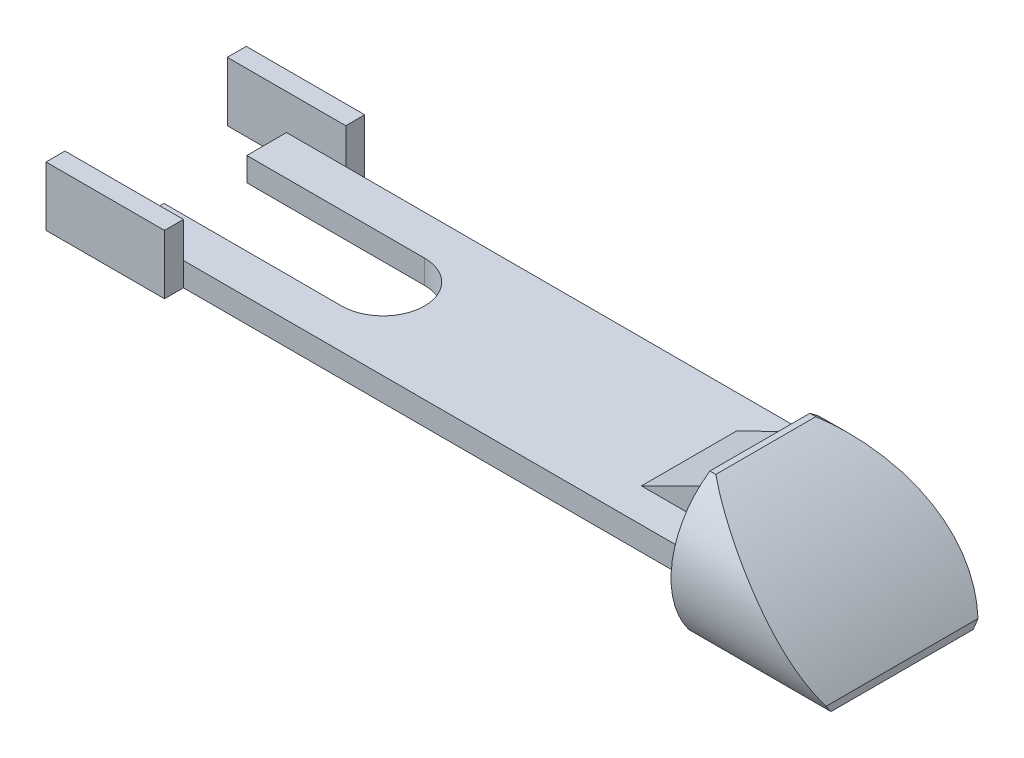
from build123d import *

# Parameters (mm, degrees)
SKETCH1_W               = 59.436
SKETCH1_H               = 17.399
BOSS_EXTRUDE1_DEPTH     = 2.54
CUT_EXTRUDE1_DEPTH      = 32.069155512
SKETCH3_W               = 12.7
SKETCH3_H               = 6.35
BOSS_EXTRUDE2_DEPTH     = 2.032
BOSS_EXTRUDE3_DEPTH     = 15.24
CUT_EXTRUDE2_DEPTH      = 47.886984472
CUT_EXTRUDE2_DEPTH_BACK = 47.886984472
RIB2_REACH              = 48.887
SKETCH12_WALL_W         = 104.28296917
SKETCH12_WALL_H         = 10.16


with BuildPart() as part:
    # Sketch1 → Boss-Extrude1 (new body)
    with BuildSketch(Plane(origin=(0, 0, 0), x_dir=(1, 0, 0), z_dir=(0, 1, 0))):
        Rectangle(SKETCH1_W, SKETCH1_H)
    extrude(amount=BOSS_EXTRUDE1_DEPTH)

    # Sketch2 → Cut-Extrude1 (cut, through all)
    with BuildSketch(Plane(origin=(0, 2.54, 0), x_dir=(1, 0, 0), z_dir=(0, 1, 0))):
        with BuildLine():
            Line((-29.718, -4.445), (-10.668, -4.445))
            ThreePointArc((-10.668, -4.445), (-6.223, 0), (-10.668, 4.445))
            Line((-10.668, 4.445), (-29.718, 4.445))
            Line((-29.718, 4.445), (-29.718, -4.445))
        make_face()
    extrude(amount=-CUT_EXTRUDE1_DEPTH, mode=Mode.SUBTRACT)

    # Sketch3 → Boss-Extrude2 (add)
    with BuildSketch(Plane.XY.offset(8.6995)):
        with Locations((-29.718, 3.175)):
            Rectangle(SKETCH3_W, SKETCH3_H)
    boss_extrude2 = extrude(amount=BOSS_EXTRUDE2_DEPTH)

    # Mirror1: Boss-Extrude2 across plane
    add(boss_extrude2.mirror(Plane.XY))

    # Sketch6 → Boss-Extrude3 (add)
    with BuildSketch(Plane(origin=(29.718, 0, 0), x_dir=(0, 0, -1), z_dir=(1, 0, 0))):
        with BuildLine():
            Line((-5.3594, 7.874163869), (5.3594, 7.874163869))
            ThreePointArc((5.3594, 7.874163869), (9.395879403, 1.563033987), (7.62, -5.715))
            Line((7.62, -5.715), (-7.62, -5.715))
            ThreePointArc((-7.62, -5.715), (-9.395879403, 1.563033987), (-5.3594, 7.874163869))
        make_face()
    extrude(amount=BOSS_EXTRUDE3_DEPTH)

    # Sketch7 → Cut-Extrude2 (cut, two sides: drawn at the far end of the back side and taken through both)
    with BuildSketch(Plane.XY.offset(-CUT_EXTRUDE2_DEPTH_BACK)):
        with BuildLine():
            Line((44.958, -180.030282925), (44.958, -5.715))
            Line((44.958, -5.715), (44.958, -4.953))
            ThreePointArc((44.958, -4.953), (38.487292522, 2.407660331), (30.353, 7.874163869))
            Line((30.353, 7.874163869), (29.718, 7.874163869))
            Line((29.718, 7.874163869), (-144.597282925, 7.874163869))
            Line((-144.597282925, 7.874163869), (100.841245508, 255.468994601))
            Line((100.841245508, 255.468994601), (290.396528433, 67.564547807))
            Line((290.396528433, 67.564547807), (44.958, -180.030282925))
        make_face()
    extrude(amount=CUT_EXTRUDE2_DEPTH + CUT_EXTRUDE2_DEPTH_BACK, mode=Mode.SUBTRACT)

    # Sketch12 wall → Rib2 (add, up to next)
    with BuildSketch(Plane(origin=(25.908, 4.433322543, 0), x_dir=(-0.895522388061, -0.445016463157, 0), z_dir=(0.445016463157, -0.895522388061, 0)), mode=Mode.PRIVATE) as rib2_sk1:
        Rectangle(SKETCH12_WALL_W, SKETCH12_WALL_H)
    rib2_tool1 = extrude(rib2_sk1.sketch, amount=RIB2_REACH, mode=Mode.PRIVATE) - part.part
    add(rib2_tool1.solids().sort_by_distance((25.908, 4.433322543, 0))[0])


solid = part.part
